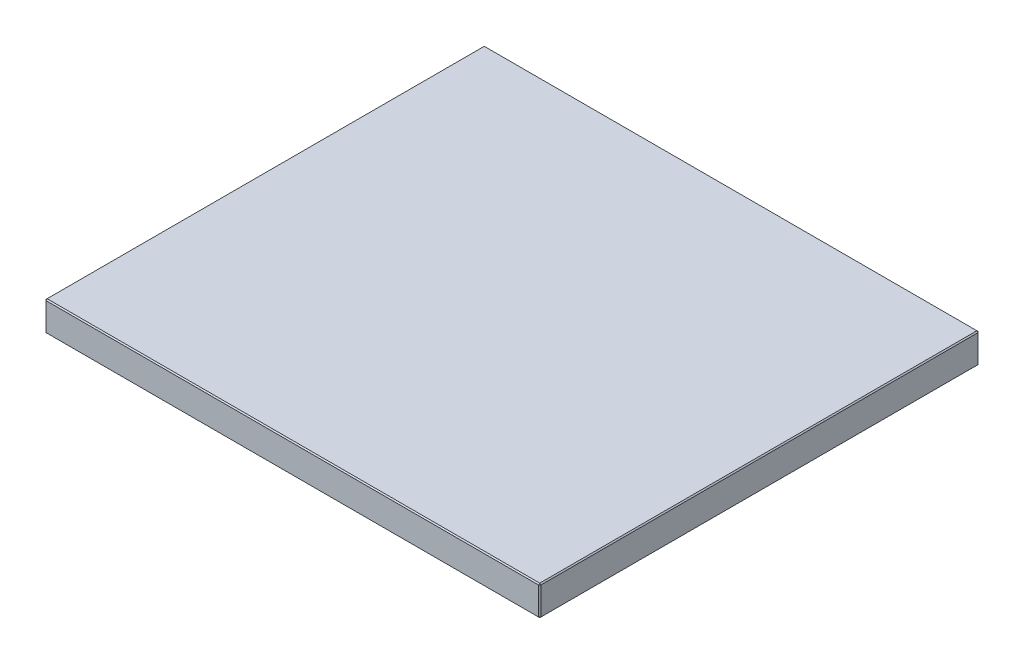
ISO-10303-21;
HEADER;
FILE_DESCRIPTION(('STEP AP214'),'2;1');
FILE_NAME('part.step','',(''),(''),'','','');
FILE_SCHEMA(('AUTOMOTIVE_DESIGN { 1 0 10303 214 1 1 1 1 }'));
ENDSEC;
DATA;
#1=APPLICATION_CONTEXT('core data for automotive mechanical design processes');
#2=APPLICATION_PROTOCOL_DEFINITION('international standard','automotive_design',2000,#1);
#3=PRODUCT_CONTEXT('',#1,'mechanical');
#4=PRODUCT('Part','Part','',(#3));
#5=PRODUCT_RELATED_PRODUCT_CATEGORY('part','',(#4));
#6=PRODUCT_DEFINITION_FORMATION('','',#4);
#7=PRODUCT_DEFINITION_CONTEXT('part definition',#1,'design');
#8=PRODUCT_DEFINITION('design','',#6,#7);
#9=PRODUCT_DEFINITION_SHAPE('','',#8);
#10=(LENGTH_UNIT() NAMED_UNIT(*) SI_UNIT(.MILLI.,.METRE.));
#11=(NAMED_UNIT(*) PLANE_ANGLE_UNIT() SI_UNIT($,.RADIAN.));
#12=(NAMED_UNIT(*) SI_UNIT($,.STERADIAN.) SOLID_ANGLE_UNIT());
#13=UNCERTAINTY_MEASURE_WITH_UNIT(LENGTH_MEASURE(1.E-05),#10,'distance_accuracy_value','');
#14=(GEOMETRIC_REPRESENTATION_CONTEXT(3) GLOBAL_UNCERTAINTY_ASSIGNED_CONTEXT((#13)) GLOBAL_UNIT_ASSIGNED_CONTEXT((#10,
#11,#12)) REPRESENTATION_CONTEXT('',''));
#15=CARTESIAN_POINT('',(0.,0.,0.));
#16=DIRECTION('',(0.,0.,1.));
#17=DIRECTION('',(1.,0.,0.));
#18=AXIS2_PLACEMENT_3D('',#15,#16,#17);
#19=CARTESIAN_POINT('',(-223.,27.,198.));
#20=DIRECTION('',(1.,0.,0.));
#21=DIRECTION('',(0.,0.,-1.));
#22=AXIS2_PLACEMENT_3D('',#19,#20,#21);
#23=PLANE('',#22);
#24=DIRECTION('',(0.,-1.,0.));
#25=VECTOR('',#24,1.);
#26=CARTESIAN_POINT('',(-223.,27.,-197.));
#27=LINE('',#26,#25);
#28=CARTESIAN_POINT('',(-223.,26.,-197.));
#29=VERTEX_POINT('',#28);
#30=CARTESIAN_POINT('',(-223.,1.,-197.));
#31=VERTEX_POINT('',#30);
#32=EDGE_CURVE('E115',#29,#31,#27,.T.);
#33=ORIENTED_EDGE('',*,*,#32,.T.);
#34=DIRECTION('',(0.,0.,1.));
#35=VECTOR('',#34,1.);
#36=CARTESIAN_POINT('',(-223.,1.,198.));
#37=LINE('',#36,#35);
#38=CARTESIAN_POINT('',(-223.,1.,197.));
#39=VERTEX_POINT('',#38);
#40=EDGE_CURVE('E111',#31,#39,#37,.T.);
#41=ORIENTED_EDGE('',*,*,#40,.T.);
#42=DIRECTION('',(0.,1.,0.));
#43=VECTOR('',#42,1.);
#44=CARTESIAN_POINT('',(-223.,27.,197.));
#45=LINE('',#44,#43);
#46=CARTESIAN_POINT('',(-223.,26.,197.));
#47=VERTEX_POINT('',#46);
#48=EDGE_CURVE('E104',#39,#47,#45,.T.);
#49=ORIENTED_EDGE('',*,*,#48,.T.);
#50=DIRECTION('',(0.,0.,-1.));
#51=VECTOR('',#50,1.);
#52=CARTESIAN_POINT('',(-223.,26.,-198.));
#53=LINE('',#52,#51);
#54=EDGE_CURVE('E108',#47,#29,#53,.T.);
#55=ORIENTED_EDGE('',*,*,#54,.T.);
#56=EDGE_LOOP('',(#33,#41,#49,#55));
#57=FACE_BOUND('',#56,.T.);
#58=ADVANCED_FACE('F16',(#57),#23,.F.);
#59=CARTESIAN_POINT('',(223.,27.,198.));
#60=DIRECTION('',(0.,0.,-1.));
#61=DIRECTION('',(-1.,0.,0.));
#62=AXIS2_PLACEMENT_3D('',#59,#60,#61);
#63=PLANE('',#62);
#64=DIRECTION('',(-1.,0.,0.));
#65=VECTOR('',#64,1.);
#66=CARTESIAN_POINT('',(-223.,26.,198.));
#67=LINE('',#66,#65);
#68=CARTESIAN_POINT('',(222.,26.,198.));
#69=VERTEX_POINT('',#68);
#70=CARTESIAN_POINT('',(-222.,26.,198.));
#71=VERTEX_POINT('',#70);
#72=EDGE_CURVE('E165',#69,#71,#67,.T.);
#73=ORIENTED_EDGE('',*,*,#72,.T.);
#74=DIRECTION('',(0.,-1.,0.));
#75=VECTOR('',#74,1.);
#76=CARTESIAN_POINT('',(-222.,27.,198.));
#77=LINE('',#76,#75);
#78=CARTESIAN_POINT('',(-222.,1.00000000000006,198.));
#79=VERTEX_POINT('',#78);
#80=EDGE_CURVE('E123',#71,#79,#77,.T.);
#81=ORIENTED_EDGE('',*,*,#80,.T.);
#82=DIRECTION('',(1.,0.,0.));
#83=VECTOR('',#82,1.);
#84=CARTESIAN_POINT('',(223.,1.00000000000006,198.));
#85=LINE('',#84,#83);
#86=CARTESIAN_POINT('',(222.,1.00000000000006,198.));
#87=VERTEX_POINT('',#86);
#88=EDGE_CURVE('E169',#79,#87,#85,.T.);
#89=ORIENTED_EDGE('',*,*,#88,.T.);
#90=DIRECTION('',(0.,1.,0.));
#91=VECTOR('',#90,1.);
#92=CARTESIAN_POINT('',(222.,27.,198.));
#93=LINE('',#92,#91);
#94=EDGE_CURVE('E167',#87,#69,#93,.T.);
#95=ORIENTED_EDGE('',*,*,#94,.T.);
#96=EDGE_LOOP('',(#73,#81,#89,#95));
#97=FACE_BOUND('',#96,.T.);
#98=ADVANCED_FACE('F276',(#97),#63,.F.);
#99=CARTESIAN_POINT('',(223.,27.,198.));
#100=DIRECTION('',(-1.,0.,0.));
#101=DIRECTION('',(0.,0.,1.));
#102=AXIS2_PLACEMENT_3D('',#99,#100,#101);
#103=PLANE('',#102);
#104=DIRECTION('',(0.,0.,-1.));
#105=VECTOR('',#104,1.);
#106=CARTESIAN_POINT('',(223.,1.00000000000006,198.));
#107=LINE('',#106,#105);
#108=CARTESIAN_POINT('',(223.,1.00000000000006,197.));
#109=VERTEX_POINT('',#108);
#110=CARTESIAN_POINT('',(223.,1.00000000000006,-197.));
#111=VERTEX_POINT('',#110);
#112=EDGE_CURVE('E160',#109,#111,#107,.T.);
#113=ORIENTED_EDGE('',*,*,#112,.T.);
#114=DIRECTION('',(0.,1.,0.));
#115=VECTOR('',#114,1.);
#116=CARTESIAN_POINT('',(223.,27.,-197.));
#117=LINE('',#116,#115);
#118=CARTESIAN_POINT('',(223.,26.,-197.));
#119=VERTEX_POINT('',#118);
#120=EDGE_CURVE('E162',#111,#119,#117,.T.);
#121=ORIENTED_EDGE('',*,*,#120,.T.);
#122=DIRECTION('',(0.,0.,1.));
#123=VECTOR('',#122,1.);
#124=CARTESIAN_POINT('',(223.,26.,198.));
#125=LINE('',#124,#123);
#126=CARTESIAN_POINT('',(223.,26.,197.));
#127=VERTEX_POINT('',#126);
#128=EDGE_CURVE('E156',#119,#127,#125,.T.);
#129=ORIENTED_EDGE('',*,*,#128,.T.);
#130=DIRECTION('',(0.,-1.,0.));
#131=VECTOR('',#130,1.);
#132=CARTESIAN_POINT('',(223.,27.,197.));
#133=LINE('',#132,#131);
#134=EDGE_CURVE('E158',#127,#109,#133,.T.);
#135=ORIENTED_EDGE('',*,*,#134,.T.);
#136=EDGE_LOOP('',(#113,#121,#129,#135));
#137=FACE_BOUND('',#136,.T.);
#138=ADVANCED_FACE('F255',(#137),#103,.F.);
#139=CARTESIAN_POINT('',(223.,27.,-198.));
#140=DIRECTION('',(0.,0.,1.));
#141=DIRECTION('',(1.,0.,0.));
#142=AXIS2_PLACEMENT_3D('',#139,#140,#141);
#143=PLANE('',#142);
#144=DIRECTION('',(0.,-1.,0.));
#145=VECTOR('',#144,1.);
#146=CARTESIAN_POINT('',(222.,27.,-198.));
#147=LINE('',#146,#145);
#148=CARTESIAN_POINT('',(222.,26.,-198.));
#149=VERTEX_POINT('',#148);
#150=CARTESIAN_POINT('',(222.,1.00000000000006,-198.));
#151=VERTEX_POINT('',#150);
#152=EDGE_CURVE('E149',#149,#151,#147,.T.);
#153=ORIENTED_EDGE('',*,*,#152,.T.);
#154=DIRECTION('',(-1.,0.,0.));
#155=VECTOR('',#154,1.);
#156=CARTESIAN_POINT('',(223.,1.00000000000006,-198.));
#157=LINE('',#156,#155);
#158=CARTESIAN_POINT('',(-222.,1.00000000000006,-198.));
#159=VERTEX_POINT('',#158);
#160=EDGE_CURVE('E154',#151,#159,#157,.T.);
#161=ORIENTED_EDGE('',*,*,#160,.T.);
#162=DIRECTION('',(0.,1.,0.));
#163=VECTOR('',#162,1.);
#164=CARTESIAN_POINT('',(-222.,27.,-198.));
#165=LINE('',#164,#163);
#166=CARTESIAN_POINT('',(-222.,26.,-198.));
#167=VERTEX_POINT('',#166);
#168=EDGE_CURVE('E151',#159,#167,#165,.T.);
#169=ORIENTED_EDGE('',*,*,#168,.T.);
#170=DIRECTION('',(1.,0.,0.));
#171=VECTOR('',#170,1.);
#172=CARTESIAN_POINT('',(223.,26.,-198.));
#173=LINE('',#172,#171);
#174=EDGE_CURVE('E147',#167,#149,#173,.T.);
#175=ORIENTED_EDGE('',*,*,#174,.T.);
#176=EDGE_LOOP('',(#153,#161,#169,#175));
#177=FACE_BOUND('',#176,.T.);
#178=ADVANCED_FACE('F285',(#177),#143,.F.);
#179=CARTESIAN_POINT('',(0.,27.,0.));
#180=DIRECTION('',(0.,1.,0.));
#181=DIRECTION('',(0.,0.,1.));
#182=AXIS2_PLACEMENT_3D('',#179,#180,#181);
#183=PLANE('',#182);
#184=DIRECTION('',(0.,0.,-1.));
#185=VECTOR('',#184,1.);
#186=CARTESIAN_POINT('',(222.,27.,-198.));
#187=LINE('',#186,#185);
#188=CARTESIAN_POINT('',(222.,27.,197.));
#189=VERTEX_POINT('',#188);
#190=CARTESIAN_POINT('',(222.,27.,-197.));
#191=VERTEX_POINT('',#190);
#192=EDGE_CURVE('E25',#189,#191,#187,.T.);
#193=ORIENTED_EDGE('',*,*,#192,.T.);
#194=DIRECTION('',(-1.,0.,0.));
#195=VECTOR('',#194,1.);
#196=CARTESIAN_POINT('',(-223.,27.,-197.));
#197=LINE('',#196,#195);
#198=CARTESIAN_POINT('',(-222.,27.,-197.));
#199=VERTEX_POINT('',#198);
#200=EDGE_CURVE('E10',#191,#199,#197,.T.);
#201=ORIENTED_EDGE('',*,*,#200,.T.);
#202=DIRECTION('',(0.,0.,1.));
#203=VECTOR('',#202,1.);
#204=CARTESIAN_POINT('',(-222.,27.,198.));
#205=LINE('',#204,#203);
#206=CARTESIAN_POINT('',(-222.,27.,197.));
#207=VERTEX_POINT('',#206);
#208=EDGE_CURVE('E181',#199,#207,#205,.T.);
#209=ORIENTED_EDGE('',*,*,#208,.T.);
#210=DIRECTION('',(1.,0.,0.));
#211=VECTOR('',#210,1.);
#212=CARTESIAN_POINT('',(223.,27.,197.));
#213=LINE('',#212,#211);
#214=EDGE_CURVE('E36',#207,#189,#213,.T.);
#215=ORIENTED_EDGE('',*,*,#214,.T.);
#216=EDGE_LOOP('',(#193,#201,#209,#215));
#217=FACE_BOUND('',#216,.T.);
#218=ADVANCED_FACE('F351',(#217),#183,.T.);
#219=CARTESIAN_POINT('',(0.,0.,0.));
#220=DIRECTION('',(0.,1.,0.));
#221=DIRECTION('',(0.,0.,1.));
#222=AXIS2_PLACEMENT_3D('',#219,#220,#221);
#223=PLANE('',#222);
#224=DIRECTION('',(0.,0.,1.));
#225=VECTOR('',#224,1.);
#226=CARTESIAN_POINT('',(222.,0.,0.));
#227=LINE('',#226,#225);
#228=CARTESIAN_POINT('',(222.,0.,-197.));
#229=VERTEX_POINT('',#228);
#230=CARTESIAN_POINT('',(222.,0.,197.));
#231=VERTEX_POINT('',#230);
#232=EDGE_CURVE('E172',#229,#231,#227,.T.);
#233=ORIENTED_EDGE('',*,*,#232,.T.);
#234=DIRECTION('',(-1.,0.,0.));
#235=VECTOR('',#234,1.);
#236=CARTESIAN_POINT('',(0.,0.,197.));
#237=LINE('',#236,#235);
#238=CARTESIAN_POINT('',(-222.,0.,197.));
#239=VERTEX_POINT('',#238);
#240=EDGE_CURVE('E178',#231,#239,#237,.T.);
#241=ORIENTED_EDGE('',*,*,#240,.T.);
#242=DIRECTION('',(0.,0.,-1.));
#243=VECTOR('',#242,1.);
#244=CARTESIAN_POINT('',(-222.,0.,0.));
#245=LINE('',#244,#243);
#246=CARTESIAN_POINT('',(-222.,0.,-197.));
#247=VERTEX_POINT('',#246);
#248=EDGE_CURVE('E176',#239,#247,#245,.T.);
#249=ORIENTED_EDGE('',*,*,#248,.T.);
#250=DIRECTION('',(1.,0.,0.));
#251=VECTOR('',#250,1.);
#252=CARTESIAN_POINT('',(0.,0.,-197.));
#253=LINE('',#252,#251);
#254=EDGE_CURVE('E174',#247,#229,#253,.T.);
#255=ORIENTED_EDGE('',*,*,#254,.T.);
#256=EDGE_LOOP('',(#233,#241,#249,#255));
#257=FACE_BOUND('',#256,.T.);
#258=ADVANCED_FACE('F247',(#257),#223,.F.);
#259=CARTESIAN_POINT('',(223.,27.,197.));
#260=DIRECTION('',(-0.707106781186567,0.,-0.707106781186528));
#261=DIRECTION('',(0.,-1.,0.));
#262=AXIS2_PLACEMENT_3D('',#259,#260,#261);
#263=PLANE('',#262);
#264=DIRECTION('',(-0.707106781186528,0.,0.707106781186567));
#265=VECTOR('',#264,1.);
#266=CARTESIAN_POINT('',(222.,26.,198.));
#267=LINE('',#266,#265);
#268=EDGE_CURVE('E20',#69,#127,#267,.F.);
#269=ORIENTED_EDGE('',*,*,#268,.F.);
#270=ORIENTED_EDGE('',*,*,#94,.F.);
#271=DIRECTION('',(0.707106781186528,0.,-0.707106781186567));
#272=VECTOR('',#271,1.);
#273=CARTESIAN_POINT('',(222.,1.00000000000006,198.));
#274=LINE('',#273,#272);
#275=EDGE_CURVE('E143',#109,#87,#274,.F.);
#276=ORIENTED_EDGE('',*,*,#275,.F.);
#277=ORIENTED_EDGE('',*,*,#134,.F.);
#278=EDGE_LOOP('',(#269,#270,#276,#277));
#279=FACE_BOUND('',#278,.T.);
#280=ADVANCED_FACE('F18',(#279),#263,.F.);
#281=CARTESIAN_POINT('',(222.,26.,198.));
#282=DIRECTION('',(0.577350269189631,0.577350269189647,0.577350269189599));
#283=DIRECTION('',(-0.707106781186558,0.707106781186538,0.));
#284=AXIS2_PLACEMENT_3D('',#281,#282,#283);
#285=PLANE('',#284);
#286=DIRECTION('',(0.,-0.707106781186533,0.707106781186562));
#287=VECTOR('',#286,1.);
#288=CARTESIAN_POINT('',(222.,26.,198.));
#289=LINE('',#288,#287);
#290=EDGE_CURVE('E227',#69,#189,#289,.F.);
#291=ORIENTED_EDGE('',*,*,#290,.F.);
#292=ORIENTED_EDGE('',*,*,#268,.T.);
#293=DIRECTION('',(-0.707106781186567,0.707106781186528,0.));
#294=VECTOR('',#293,1.);
#295=CARTESIAN_POINT('',(222.5,26.5,197.));
#296=LINE('',#295,#294);
#297=EDGE_CURVE('E229',#189,#127,#296,.F.);
#298=ORIENTED_EDGE('',*,*,#297,.F.);
#299=EDGE_LOOP('',(#291,#292,#298));
#300=FACE_BOUND('',#299,.T.);
#301=ADVANCED_FACE('F271',(#300),#285,.T.);
#302=CARTESIAN_POINT('',(222.,1.00000000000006,198.));
#303=DIRECTION('',(0.577350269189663,-0.577350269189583,0.577350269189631));
#304=DIRECTION('',(0.707106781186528,0.,-0.707106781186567));
#305=AXIS2_PLACEMENT_3D('',#302,#303,#304);
#306=PLANE('',#305);
#307=DIRECTION('',(-0.707106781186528,-0.707106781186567,0.));
#308=VECTOR('',#307,1.);
#309=CARTESIAN_POINT('',(222.5,0.500000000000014,197.));
#310=LINE('',#309,#308);
#311=EDGE_CURVE('E221',#109,#231,#310,.T.);
#312=ORIENTED_EDGE('',*,*,#311,.F.);
#313=ORIENTED_EDGE('',*,*,#275,.T.);
#314=DIRECTION('',(0.,0.707106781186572,0.707106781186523));
#315=VECTOR('',#314,1.);
#316=CARTESIAN_POINT('',(222.,1.00000000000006,198.));
#317=LINE('',#316,#315);
#318=EDGE_CURVE('E224',#231,#87,#317,.T.);
#319=ORIENTED_EDGE('',*,*,#318,.F.);
#320=EDGE_LOOP('',(#312,#313,#319));
#321=FACE_BOUND('',#320,.T.);
#322=ADVANCED_FACE('F236',(#321),#306,.T.);
#323=CARTESIAN_POINT('',(222.,27.,0.));
#324=DIRECTION('',(0.707106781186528,0.707106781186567,0.));
#325=DIRECTION('',(0.,0.,1.));
#326=AXIS2_PLACEMENT_3D('',#323,#324,#325);
#327=PLANE('',#326);
#328=ORIENTED_EDGE('',*,*,#297,.T.);
#329=ORIENTED_EDGE('',*,*,#128,.F.);
#330=DIRECTION('',(0.707106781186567,-0.707106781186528,0.));
#331=VECTOR('',#330,1.);
#332=CARTESIAN_POINT('',(223.,26.,-197.));
#333=LINE('',#332,#331);
#334=EDGE_CURVE('E216',#191,#119,#333,.T.);
#335=ORIENTED_EDGE('',*,*,#334,.F.);
#336=ORIENTED_EDGE('',*,*,#192,.F.);
#337=EDGE_LOOP('',(#328,#329,#335,#336));
#338=FACE_BOUND('',#337,.T.);
#339=ADVANCED_FACE('F266',(#338),#327,.T.);
#340=CARTESIAN_POINT('',(0.,27.,197.));
#341=DIRECTION('',(0.,0.707106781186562,0.707106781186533));
#342=DIRECTION('',(-1.,0.,0.));
#343=AXIS2_PLACEMENT_3D('',#340,#341,#342);
#344=PLANE('',#343);
#345=ORIENTED_EDGE('',*,*,#290,.T.);
#346=ORIENTED_EDGE('',*,*,#214,.F.);
#347=DIRECTION('',(0.,0.707106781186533,-0.707106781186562));
#348=VECTOR('',#347,1.);
#349=CARTESIAN_POINT('',(-222.,26.5,197.5));
#350=LINE('',#349,#348);
#351=EDGE_CURVE('E127',#71,#207,#350,.T.);
#352=ORIENTED_EDGE('',*,*,#351,.F.);
#353=ORIENTED_EDGE('',*,*,#72,.F.);
#354=EDGE_LOOP('',(#345,#346,#352,#353));
#355=FACE_BOUND('',#354,.T.);
#356=ADVANCED_FACE('F274',(#355),#344,.T.);
#357=CARTESIAN_POINT('',(-222.,27.,198.));
#358=DIRECTION('',(0.707106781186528,0.,-0.707106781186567));
#359=DIRECTION('',(0.,-1.,0.));
#360=AXIS2_PLACEMENT_3D('',#357,#358,#359);
#361=PLANE('',#360);
#362=DIRECTION('',(0.707106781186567,0.,0.707106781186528));
#363=VECTOR('',#362,1.);
#364=CARTESIAN_POINT('',(-222.,1.00000000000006,198.));
#365=LINE('',#364,#363);
#366=EDGE_CURVE('E128',#79,#39,#365,.F.);
#367=ORIENTED_EDGE('',*,*,#366,.F.);
#368=ORIENTED_EDGE('',*,*,#80,.F.);
#369=DIRECTION('',(-0.707106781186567,0.,-0.707106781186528));
#370=VECTOR('',#369,1.);
#371=CARTESIAN_POINT('',(-223.,26.,197.));
#372=LINE('',#371,#370);
#373=EDGE_CURVE('E119',#47,#71,#372,.F.);
#374=ORIENTED_EDGE('',*,*,#373,.F.);
#375=ORIENTED_EDGE('',*,*,#48,.F.);
#376=EDGE_LOOP('',(#367,#368,#374,#375));
#377=FACE_BOUND('',#376,.T.);
#378=ADVANCED_FACE('F121',(#377),#361,.F.);
#379=CARTESIAN_POINT('',(223.,1.00000000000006,198.));
#380=DIRECTION('',(0.,0.707106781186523,-0.707106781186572));
#381=DIRECTION('',(1.,0.,0.));
#382=AXIS2_PLACEMENT_3D('',#379,#380,#381);
#383=PLANE('',#382);
#384=ORIENTED_EDGE('',*,*,#318,.T.);
#385=ORIENTED_EDGE('',*,*,#88,.F.);
#386=DIRECTION('',(0.,-0.707106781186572,-0.707106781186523));
#387=VECTOR('',#386,1.);
#388=CARTESIAN_POINT('',(-222.,1.00000000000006,198.));
#389=LINE('',#388,#387);
#390=EDGE_CURVE('E212',#239,#79,#389,.F.);
#391=ORIENTED_EDGE('',*,*,#390,.F.);
#392=ORIENTED_EDGE('',*,*,#240,.F.);
#393=EDGE_LOOP('',(#384,#385,#391,#392));
#394=FACE_BOUND('',#393,.T.);
#395=ADVANCED_FACE('F244',(#394),#383,.F.);
#396=CARTESIAN_POINT('',(223.,1.00000000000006,198.));
#397=DIRECTION('',(-0.707106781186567,0.707106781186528,0.));
#398=DIRECTION('',(0.,0.,-1.));
#399=AXIS2_PLACEMENT_3D('',#396,#397,#398);
#400=PLANE('',#399);
#401=ORIENTED_EDGE('',*,*,#311,.T.);
#402=ORIENTED_EDGE('',*,*,#232,.F.);
#403=DIRECTION('',(0.707106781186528,0.707106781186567,0.));
#404=VECTOR('',#403,1.);
#405=CARTESIAN_POINT('',(222.5,0.500000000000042,-197.));
#406=LINE('',#405,#404);
#407=EDGE_CURVE('E209',#111,#229,#406,.F.);
#408=ORIENTED_EDGE('',*,*,#407,.F.);
#409=ORIENTED_EDGE('',*,*,#112,.F.);
#410=EDGE_LOOP('',(#401,#402,#408,#409));
#411=FACE_BOUND('',#410,.T.);
#412=ADVANCED_FACE('F252',(#411),#400,.F.);
#413=CARTESIAN_POINT('',(222.,27.,-198.));
#414=DIRECTION('',(-0.707106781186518,0.,0.707106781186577));
#415=DIRECTION('',(0.,-1.,0.));
#416=AXIS2_PLACEMENT_3D('',#413,#414,#415);
#417=PLANE('',#416);
#418=DIRECTION('',(0.707106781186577,0.,0.707106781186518));
#419=VECTOR('',#418,1.);
#420=CARTESIAN_POINT('',(223.,26.,-197.));
#421=LINE('',#420,#419);
#422=EDGE_CURVE('E218',#119,#149,#421,.F.);
#423=ORIENTED_EDGE('',*,*,#422,.F.);
#424=ORIENTED_EDGE('',*,*,#120,.F.);
#425=DIRECTION('',(-0.707106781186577,0.,-0.707106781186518));
#426=VECTOR('',#425,1.);
#427=CARTESIAN_POINT('',(222.,1.00000000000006,-198.));
#428=LINE('',#427,#426);
#429=EDGE_CURVE('E206',#151,#111,#428,.F.);
#430=ORIENTED_EDGE('',*,*,#429,.F.);
#431=ORIENTED_EDGE('',*,*,#152,.F.);
#432=EDGE_LOOP('',(#423,#424,#430,#431));
#433=FACE_BOUND('',#432,.T.);
#434=ADVANCED_FACE('F259',(#433),#417,.F.);
#435=CARTESIAN_POINT('',(223.,26.,-197.));
#436=DIRECTION('',(0.577350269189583,0.577350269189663,-0.577350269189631));
#437=DIRECTION('',(0.,0.707106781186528,0.707106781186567));
#438=AXIS2_PLACEMENT_3D('',#435,#436,#437);
#439=PLANE('',#438);
#440=ORIENTED_EDGE('',*,*,#334,.T.);
#441=ORIENTED_EDGE('',*,*,#422,.T.);
#442=DIRECTION('',(0.,0.707106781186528,0.707106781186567));
#443=VECTOR('',#442,1.);
#444=CARTESIAN_POINT('',(222.,26.5,-197.5));
#445=LINE('',#444,#443);
#446=EDGE_CURVE('E135',#191,#149,#445,.F.);
#447=ORIENTED_EDGE('',*,*,#446,.F.);
#448=EDGE_LOOP('',(#440,#441,#447));
#449=FACE_BOUND('',#448,.T.);
#450=ADVANCED_FACE('F326',(#449),#439,.T.);
#451=CARTESIAN_POINT('',(-223.,26.,197.));
#452=DIRECTION('',(-0.577350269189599,0.577350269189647,0.577350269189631));
#453=DIRECTION('',(0.,-0.707106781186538,0.707106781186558));
#454=AXIS2_PLACEMENT_3D('',#451,#452,#453);
#455=PLANE('',#454);
#456=ORIENTED_EDGE('',*,*,#373,.T.);
#457=ORIENTED_EDGE('',*,*,#351,.T.);
#458=DIRECTION('',(-0.707106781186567,-0.707106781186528,0.));
#459=VECTOR('',#458,1.);
#460=CARTESIAN_POINT('',(-223.,26.,197.));
#461=LINE('',#460,#459);
#462=EDGE_CURVE('E131',#47,#207,#461,.F.);
#463=ORIENTED_EDGE('',*,*,#462,.F.);
#464=EDGE_LOOP('',(#456,#457,#463));
#465=FACE_BOUND('',#464,.T.);
#466=ADVANCED_FACE('F132',(#465),#455,.T.);
#467=CARTESIAN_POINT('',(-222.,1.00000000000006,198.));
#468=DIRECTION('',(-0.577350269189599,-0.577350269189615,0.577350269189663));
#469=DIRECTION('',(0.,-0.707106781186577,-0.707106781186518));
#470=AXIS2_PLACEMENT_3D('',#467,#468,#469);
#471=PLANE('',#470);
#472=ORIENTED_EDGE('',*,*,#390,.T.);
#473=ORIENTED_EDGE('',*,*,#366,.T.);
#474=DIRECTION('',(-0.707106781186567,0.707106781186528,0.));
#475=VECTOR('',#474,1.);
#476=CARTESIAN_POINT('',(-222.5,0.499999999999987,197.));
#477=LINE('',#476,#475);
#478=EDGE_CURVE('E136',#239,#39,#477,.T.);
#479=ORIENTED_EDGE('',*,*,#478,.F.);
#480=EDGE_LOOP('',(#472,#473,#479));
#481=FACE_BOUND('',#480,.T.);
#482=ADVANCED_FACE('F319',(#481),#471,.T.);
#483=CARTESIAN_POINT('',(222.,1.00000000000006,-198.));
#484=DIRECTION('',(0.577350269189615,-0.577350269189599,-0.577350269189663));
#485=DIRECTION('',(-0.707106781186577,0.,-0.707106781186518));
#486=AXIS2_PLACEMENT_3D('',#483,#484,#485);
#487=PLANE('',#486);
#488=ORIENTED_EDGE('',*,*,#429,.T.);
#489=ORIENTED_EDGE('',*,*,#407,.T.);
#490=DIRECTION('',(0.,-0.707106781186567,0.707106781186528));
#491=VECTOR('',#490,1.);
#492=CARTESIAN_POINT('',(222.,1.00000000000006,-198.));
#493=LINE('',#492,#491);
#494=EDGE_CURVE('E199',#151,#229,#493,.T.);
#495=ORIENTED_EDGE('',*,*,#494,.F.);
#496=EDGE_LOOP('',(#488,#489,#495));
#497=FACE_BOUND('',#496,.T.);
#498=ADVANCED_FACE('F315',(#497),#487,.T.);
#499=CARTESIAN_POINT('',(0.,27.,-197.));
#500=DIRECTION('',(0.,0.707106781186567,-0.707106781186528));
#501=DIRECTION('',(1.,0.,0.));
#502=AXIS2_PLACEMENT_3D('',#499,#500,#501);
#503=PLANE('',#502);
#504=ORIENTED_EDGE('',*,*,#446,.T.);
#505=ORIENTED_EDGE('',*,*,#174,.F.);
#506=DIRECTION('',(0.,-0.707106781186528,-0.707106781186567));
#507=VECTOR('',#506,1.);
#508=CARTESIAN_POINT('',(-222.,26.,-198.));
#509=LINE('',#508,#507);
#510=EDGE_CURVE('E196',#199,#167,#509,.T.);
#511=ORIENTED_EDGE('',*,*,#510,.F.);
#512=ORIENTED_EDGE('',*,*,#200,.F.);
#513=EDGE_LOOP('',(#504,#505,#511,#512));
#514=FACE_BOUND('',#513,.T.);
#515=ADVANCED_FACE('F312',(#514),#503,.T.);
#516=CARTESIAN_POINT('',(-222.,27.,0.));
#517=DIRECTION('',(-0.707106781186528,0.707106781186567,0.));
#518=DIRECTION('',(0.,0.,-1.));
#519=AXIS2_PLACEMENT_3D('',#516,#517,#518);
#520=PLANE('',#519);
#521=ORIENTED_EDGE('',*,*,#462,.T.);
#522=ORIENTED_EDGE('',*,*,#208,.F.);
#523=DIRECTION('',(0.707106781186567,0.707106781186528,0.));
#524=VECTOR('',#523,1.);
#525=CARTESIAN_POINT('',(-222.5,26.5,-197.));
#526=LINE('',#525,#524);
#527=EDGE_CURVE('E139',#29,#199,#526,.T.);
#528=ORIENTED_EDGE('',*,*,#527,.F.);
#529=ORIENTED_EDGE('',*,*,#54,.F.);
#530=EDGE_LOOP('',(#521,#522,#528,#529));
#531=FACE_BOUND('',#530,.T.);
#532=ADVANCED_FACE('F138',(#531),#520,.T.);
#533=CARTESIAN_POINT('',(-223.,1.,198.));
#534=DIRECTION('',(0.707106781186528,0.707106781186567,0.));
#535=DIRECTION('',(0.,0.,1.));
#536=AXIS2_PLACEMENT_3D('',#533,#534,#535);
#537=PLANE('',#536);
#538=ORIENTED_EDGE('',*,*,#478,.T.);
#539=ORIENTED_EDGE('',*,*,#40,.F.);
#540=DIRECTION('',(0.707106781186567,-0.707106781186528,0.));
#541=VECTOR('',#540,1.);
#542=CARTESIAN_POINT('',(-223.,1.,-197.));
#543=LINE('',#542,#541);
#544=EDGE_CURVE('E192',#247,#31,#543,.F.);
#545=ORIENTED_EDGE('',*,*,#544,.F.);
#546=ORIENTED_EDGE('',*,*,#248,.F.);
#547=EDGE_LOOP('',(#538,#539,#545,#546));
#548=FACE_BOUND('',#547,.T.);
#549=ADVANCED_FACE('F305',(#548),#537,.F.);
#550=CARTESIAN_POINT('',(223.,1.00000000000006,-198.));
#551=DIRECTION('',(0.,0.707106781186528,0.707106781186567));
#552=DIRECTION('',(-1.,0.,0.));
#553=AXIS2_PLACEMENT_3D('',#550,#551,#552);
#554=PLANE('',#553);
#555=ORIENTED_EDGE('',*,*,#494,.T.);
#556=ORIENTED_EDGE('',*,*,#254,.F.);
#557=DIRECTION('',(0.,0.707106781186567,-0.707106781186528));
#558=VECTOR('',#557,1.);
#559=CARTESIAN_POINT('',(-222.,0.500000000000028,-197.5));
#560=LINE('',#559,#558);
#561=EDGE_CURVE('E189',#159,#247,#560,.F.);
#562=ORIENTED_EDGE('',*,*,#561,.F.);
#563=ORIENTED_EDGE('',*,*,#160,.F.);
#564=EDGE_LOOP('',(#555,#556,#562,#563));
#565=FACE_BOUND('',#564,.T.);
#566=ADVANCED_FACE('F301',(#565),#554,.F.);
#567=CARTESIAN_POINT('',(-222.,26.,-198.));
#568=DIRECTION('',(-0.577350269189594,0.577350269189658,-0.577350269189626));
#569=DIRECTION('',(0.,0.707106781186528,0.707106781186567));
#570=AXIS2_PLACEMENT_3D('',#567,#568,#569);
#571=PLANE('',#570);
#572=ORIENTED_EDGE('',*,*,#527,.T.);
#573=ORIENTED_EDGE('',*,*,#510,.T.);
#574=DIRECTION('',(0.707106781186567,0.,-0.707106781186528));
#575=VECTOR('',#574,1.);
#576=CARTESIAN_POINT('',(-222.,26.,-198.));
#577=LINE('',#576,#575);
#578=EDGE_CURVE('E187',#29,#167,#577,.T.);
#579=ORIENTED_EDGE('',*,*,#578,.F.);
#580=EDGE_LOOP('',(#572,#573,#579));
#581=FACE_BOUND('',#580,.T.);
#582=ADVANCED_FACE('F297',(#581),#571,.T.);
#583=CARTESIAN_POINT('',(-223.,1.,-197.));
#584=DIRECTION('',(-0.577350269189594,-0.577350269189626,-0.577350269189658));
#585=DIRECTION('',(0.,0.707106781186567,-0.707106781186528));
#586=AXIS2_PLACEMENT_3D('',#583,#584,#585);
#587=PLANE('',#586);
#588=ORIENTED_EDGE('',*,*,#561,.T.);
#589=ORIENTED_EDGE('',*,*,#544,.T.);
#590=DIRECTION('',(-0.707106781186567,0.,0.707106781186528));
#591=VECTOR('',#590,1.);
#592=CARTESIAN_POINT('',(-223.,1.,-197.));
#593=LINE('',#592,#591);
#594=EDGE_CURVE('E185',#159,#31,#593,.T.);
#595=ORIENTED_EDGE('',*,*,#594,.F.);
#596=EDGE_LOOP('',(#588,#589,#595));
#597=FACE_BOUND('',#596,.T.);
#598=ADVANCED_FACE('F293',(#597),#587,.T.);
#599=CARTESIAN_POINT('',(-223.,27.,-197.));
#600=DIRECTION('',(0.707106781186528,0.,0.707106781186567));
#601=DIRECTION('',(0.,-1.,0.));
#602=AXIS2_PLACEMENT_3D('',#599,#600,#601);
#603=PLANE('',#602);
#604=ORIENTED_EDGE('',*,*,#578,.T.);
#605=ORIENTED_EDGE('',*,*,#168,.F.);
#606=ORIENTED_EDGE('',*,*,#594,.T.);
#607=ORIENTED_EDGE('',*,*,#32,.F.);
#608=EDGE_LOOP('',(#604,#605,#606,#607));
#609=FACE_BOUND('',#608,.T.);
#610=ADVANCED_FACE('F290',(#609),#603,.F.);
#611=CLOSED_SHELL('',(#58,#98,#138,#178,#218,#258,#280,#301,#322,#339,#356,#378,#395,#412,#434,
#450,#466,#482,#498,#515,#532,#549,#566,#582,#598,#610));
#612=MANIFOLD_SOLID_BREP('B1',#611);
#613=ADVANCED_BREP_SHAPE_REPRESENTATION('',(#18,#612),#14);
#614=SHAPE_DEFINITION_REPRESENTATION(#9,#613);
ENDSEC;
END-ISO-10303-21;
